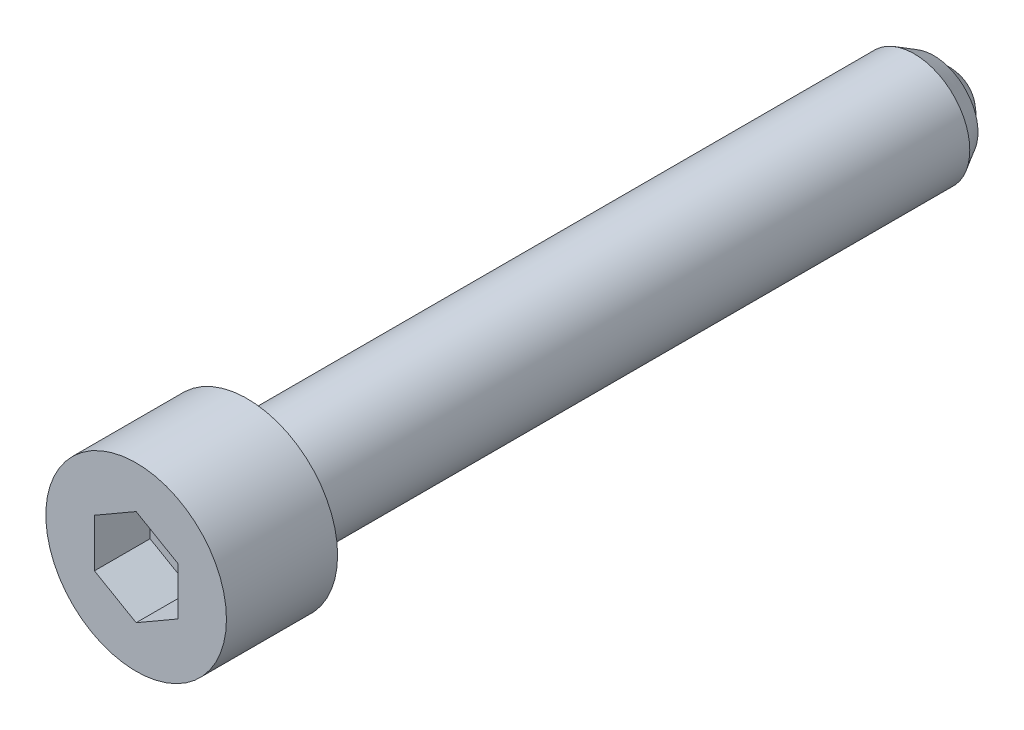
ISO-10303-21;
HEADER;
FILE_DESCRIPTION(('STEP AP214'),'2;1');
FILE_NAME('part.step','',(''),(''),'','','');
FILE_SCHEMA(('AUTOMOTIVE_DESIGN { 1 0 10303 214 1 1 1 1 }'));
ENDSEC;
DATA;
#1=APPLICATION_CONTEXT('core data for automotive mechanical design processes');
#2=APPLICATION_PROTOCOL_DEFINITION('international standard','automotive_design',2000,#1);
#3=PRODUCT_CONTEXT('',#1,'mechanical');
#4=PRODUCT('Part','Part','',(#3));
#5=PRODUCT_RELATED_PRODUCT_CATEGORY('part','',(#4));
#6=PRODUCT_DEFINITION_FORMATION('','',#4);
#7=PRODUCT_DEFINITION_CONTEXT('part definition',#1,'design');
#8=PRODUCT_DEFINITION('design','',#6,#7);
#9=PRODUCT_DEFINITION_SHAPE('','',#8);
#10=(LENGTH_UNIT() NAMED_UNIT(*) SI_UNIT(.MILLI.,.METRE.));
#11=(NAMED_UNIT(*) PLANE_ANGLE_UNIT() SI_UNIT($,.RADIAN.));
#12=(NAMED_UNIT(*) SI_UNIT($,.STERADIAN.) SOLID_ANGLE_UNIT());
#13=UNCERTAINTY_MEASURE_WITH_UNIT(LENGTH_MEASURE(1.E-05),#10,'distance_accuracy_value','');
#14=(GEOMETRIC_REPRESENTATION_CONTEXT(3) GLOBAL_UNCERTAINTY_ASSIGNED_CONTEXT((#13)) GLOBAL_UNIT_ASSIGNED_CONTEXT((#10,
#11,#12)) REPRESENTATION_CONTEXT('',''));
#15=CARTESIAN_POINT('',(0.,0.,0.));
#16=DIRECTION('',(0.,0.,1.));
#17=DIRECTION('',(1.,0.,0.));
#18=AXIS2_PLACEMENT_3D('',#15,#16,#17);
#19=CARTESIAN_POINT('',(0.,0.,2.75));
#20=DIRECTION('',(0.,0.,-1.));
#21=DIRECTION('',(1.,0.,0.));
#22=AXIS2_PLACEMENT_3D('',#19,#20,#21);
#23=SPHERICAL_SURFACE('',#22,2.75);
#24=CARTESIAN_POINT('',(0.,0.,1.90165736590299));
#25=DIRECTION('',(0.,0.,-1.));
#26=DIRECTION('',(1.,0.,0.));
#27=AXIS2_PLACEMENT_3D('',#24,#25,#26);
#28=CIRCLE('',#27,2.61587743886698);
#29=CARTESIAN_POINT('',(2.61587743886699,0.,1.90165736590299));
#30=VERTEX_POINT('',#29);
#31=EDGE_CURVE('E9',#30,#30,#28,.T.);
#32=ORIENTED_EDGE('',*,*,#31,.T.);
#33=EDGE_LOOP('',(#32));
#34=FACE_BOUND('',#33,.T.);
#35=ADVANCED_FACE('F14',(#34),#23,.T.);
#36=CARTESIAN_POINT('',(3.19170962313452,0.,1.90165736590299));
#37=DIRECTION('',(0.,0.,1.));
#38=DIRECTION('',(-1.,0.,0.));
#39=AXIS2_PLACEMENT_3D('',#36,#37,#38);
#40=PLANE('',#39);
#41=ORIENTED_EDGE('',*,*,#31,.F.);
#42=EDGE_LOOP('',(#41));
#43=FACE_BOUND('',#42,.T.);
#44=CARTESIAN_POINT('',(0.,0.,1.90165736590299));
#45=DIRECTION('',(0.,0.,-1.));
#46=DIRECTION('',(1.,0.,0.));
#47=AXIS2_PLACEMENT_3D('',#44,#45,#46);
#48=CIRCLE('',#47,3.19170962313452);
#49=CARTESIAN_POINT('',(3.19170962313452,0.,1.90165736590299));
#50=VERTEX_POINT('',#49);
#51=EDGE_CURVE('E21',#50,#50,#48,.T.);
#52=ORIENTED_EDGE('',*,*,#51,.T.);
#53=EDGE_LOOP('',(#52));
#54=FACE_BOUND('',#53,.T.);
#55=ADVANCED_FACE('F135',(#43,#54),#40,.F.);
#56=CARTESIAN_POINT('',(0.,0.,3.301657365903));
#57=DIRECTION('',(0.,0.,1.));
#58=DIRECTION('',(-1.,0.,0.));
#59=AXIS2_PLACEMENT_3D('',#56,#57,#58);
#60=CONICAL_SURFACE('',#59,4.,0.523598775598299);
#61=ORIENTED_EDGE('',*,*,#51,.F.);
#62=EDGE_LOOP('',(#61));
#63=FACE_BOUND('',#62,.T.);
#64=CARTESIAN_POINT('',(0.,0.,3.301657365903));
#65=DIRECTION('',(0.,0.,-1.));
#66=DIRECTION('',(1.,0.,0.));
#67=AXIS2_PLACEMENT_3D('',#64,#65,#66);
#68=CIRCLE('',#67,4.);
#69=CARTESIAN_POINT('',(4.,0.,3.301657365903));
#70=VERTEX_POINT('',#69);
#71=EDGE_CURVE('E130',#70,#70,#68,.T.);
#72=ORIENTED_EDGE('',*,*,#71,.T.);
#73=EDGE_LOOP('',(#72));
#74=FACE_BOUND('',#73,.T.);
#75=ADVANCED_FACE('F137',(#63,#74),#60,.T.);
#76=CARTESIAN_POINT('',(0.,0.,21.3));
#77=DIRECTION('',(0.,0.,-1.));
#78=DIRECTION('',(1.,0.,0.));
#79=AXIS2_PLACEMENT_3D('',#76,#77,#78);
#80=CYLINDRICAL_SURFACE('',#79,4.);
#81=ORIENTED_EDGE('',*,*,#71,.F.);
#82=EDGE_LOOP('',(#81));
#83=FACE_BOUND('',#82,.T.);
#84=CARTESIAN_POINT('',(0.,0.,51.3));
#85=DIRECTION('',(0.,0.,-1.));
#86=DIRECTION('',(1.,0.,0.));
#87=AXIS2_PLACEMENT_3D('',#84,#85,#86);
#88=CIRCLE('',#87,4.);
#89=CARTESIAN_POINT('',(4.,0.,51.3));
#90=VERTEX_POINT('',#89);
#91=EDGE_CURVE('E127',#90,#90,#88,.T.);
#92=ORIENTED_EDGE('',*,*,#91,.T.);
#93=EDGE_LOOP('',(#92));
#94=FACE_BOUND('',#93,.T.);
#95=ADVANCED_FACE('F140',(#83,#94),#80,.T.);
#96=CARTESIAN_POINT('',(4.,0.,51.3));
#97=DIRECTION('',(0.,0.,-1.));
#98=DIRECTION('',(1.,0.,0.));
#99=AXIS2_PLACEMENT_3D('',#96,#97,#98);
#100=PLANE('',#99);
#101=CARTESIAN_POINT('',(0.,0.,51.3));
#102=DIRECTION('',(0.,0.,-1.));
#103=DIRECTION('',(1.,0.,0.));
#104=AXIS2_PLACEMENT_3D('',#101,#102,#103);
#105=CIRCLE('',#104,6.5);
#106=CARTESIAN_POINT('',(6.5,0.,51.3));
#107=VERTEX_POINT('',#106);
#108=EDGE_CURVE('E124',#107,#107,#105,.T.);
#109=ORIENTED_EDGE('',*,*,#108,.T.);
#110=EDGE_LOOP('',(#109));
#111=FACE_BOUND('',#110,.T.);
#112=ORIENTED_EDGE('',*,*,#91,.F.);
#113=EDGE_LOOP('',(#112));
#114=FACE_BOUND('',#113,.T.);
#115=ADVANCED_FACE('F146',(#111,#114),#100,.T.);
#116=CARTESIAN_POINT('',(0.,0.,21.3));
#117=DIRECTION('',(0.,0.,-1.));
#118=DIRECTION('',(1.,0.,0.));
#119=AXIS2_PLACEMENT_3D('',#116,#117,#118);
#120=CYLINDRICAL_SURFACE('',#119,6.5);
#121=CARTESIAN_POINT('',(0.,0.,59.3));
#122=DIRECTION('',(0.,0.,-1.));
#123=DIRECTION('',(1.,0.,0.));
#124=AXIS2_PLACEMENT_3D('',#121,#122,#123);
#125=CIRCLE('',#124,6.5);
#126=CARTESIAN_POINT('',(6.5,0.,59.3));
#127=VERTEX_POINT('',#126);
#128=EDGE_CURVE('E121',#127,#127,#125,.T.);
#129=ORIENTED_EDGE('',*,*,#128,.T.);
#130=EDGE_LOOP('',(#129));
#131=FACE_BOUND('',#130,.T.);
#132=ORIENTED_EDGE('',*,*,#108,.F.);
#133=EDGE_LOOP('',(#132));
#134=FACE_BOUND('',#133,.T.);
#135=ADVANCED_FACE('F151',(#131,#134),#120,.T.);
#136=CARTESIAN_POINT('',(6.5,0.,59.3));
#137=DIRECTION('',(0.,0.,1.));
#138=DIRECTION('',(-1.,0.,0.));
#139=AXIS2_PLACEMENT_3D('',#136,#137,#138);
#140=PLANE('',#139);
#141=DIRECTION('',(-0.86602540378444,0.5,0.));
#142=VECTOR('',#141,1.);
#143=CARTESIAN_POINT('',(3.,1.73205080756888,59.3));
#144=LINE('',#143,#142);
#145=CARTESIAN_POINT('',(3.,1.73205080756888,59.3));
#146=VERTEX_POINT('',#145);
#147=CARTESIAN_POINT('',(0.,3.46410161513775,59.3));
#148=VERTEX_POINT('',#147);
#149=EDGE_CURVE('E28',#146,#148,#144,.T.);
#150=ORIENTED_EDGE('',*,*,#149,.F.);
#151=DIRECTION('',(0.,1.,0.));
#152=VECTOR('',#151,1.);
#153=CARTESIAN_POINT('',(3.,-1.73205080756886,59.3));
#154=LINE('',#153,#152);
#155=CARTESIAN_POINT('',(3.,-1.73205080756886,59.3));
#156=VERTEX_POINT('',#155);
#157=EDGE_CURVE('E97',#156,#146,#154,.T.);
#158=ORIENTED_EDGE('',*,*,#157,.F.);
#159=DIRECTION('',(-0.866025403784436,-0.5,0.));
#160=VECTOR('',#159,1.);
#161=CARTESIAN_POINT('',(3.,-1.73205080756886,59.3));
#162=LINE('',#161,#160);
#163=CARTESIAN_POINT('',(0.,-3.46410161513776,59.3));
#164=VERTEX_POINT('',#163);
#165=EDGE_CURVE('E92',#156,#164,#162,.T.);
#166=ORIENTED_EDGE('',*,*,#165,.T.);
#167=DIRECTION('',(0.866025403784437,-0.5,0.));
#168=VECTOR('',#167,1.);
#169=CARTESIAN_POINT('',(-3.,-1.73205080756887,59.3));
#170=LINE('',#169,#168);
#171=CARTESIAN_POINT('',(-3.,-1.73205080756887,59.3));
#172=VERTEX_POINT('',#171);
#173=EDGE_CURVE('E90',#172,#164,#170,.T.);
#174=ORIENTED_EDGE('',*,*,#173,.F.);
#175=DIRECTION('',(0.,1.,0.));
#176=VECTOR('',#175,1.);
#177=CARTESIAN_POINT('',(-3.,-1.73205080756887,59.3));
#178=LINE('',#177,#176);
#179=CARTESIAN_POINT('',(-3.,1.73205080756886,59.3));
#180=VERTEX_POINT('',#179);
#181=EDGE_CURVE('E71',#172,#180,#178,.T.);
#182=ORIENTED_EDGE('',*,*,#181,.T.);
#183=DIRECTION('',(0.866025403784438,0.5,0.));
#184=VECTOR('',#183,1.);
#185=CARTESIAN_POINT('',(-3.,1.73205080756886,59.3));
#186=LINE('',#185,#184);
#187=EDGE_CURVE('E82',#180,#148,#186,.T.);
#188=ORIENTED_EDGE('',*,*,#187,.T.);
#189=EDGE_LOOP('',(#150,#158,#166,#174,#182,#188));
#190=FACE_BOUND('',#189,.T.);
#191=ORIENTED_EDGE('',*,*,#128,.F.);
#192=EDGE_LOOP('',(#191));
#193=FACE_BOUND('',#192,.T.);
#194=ADVANCED_FACE('F86',(#190,#193),#140,.T.);
#195=CARTESIAN_POINT('',(3.,1.73205080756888,55.3));
#196=DIRECTION('',(0.5,0.86602540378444,0.));
#197=DIRECTION('',(0.86602540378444,-0.5,0.));
#198=AXIS2_PLACEMENT_3D('',#195,#196,#197);
#199=PLANE('',#198);
#200=DIRECTION('',(0.,0.,1.));
#201=VECTOR('',#200,1.);
#202=CARTESIAN_POINT('',(3.,1.73205080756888,55.3));
#203=LINE('',#202,#201);
#204=CARTESIAN_POINT('',(3.,1.73205080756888,55.3));
#205=VERTEX_POINT('',#204);
#206=EDGE_CURVE('E35',#205,#146,#203,.T.);
#207=ORIENTED_EDGE('',*,*,#206,.T.);
#208=ORIENTED_EDGE('',*,*,#149,.T.);
#209=DIRECTION('',(0.,0.,1.));
#210=VECTOR('',#209,1.);
#211=CARTESIAN_POINT('',(0.,3.46410161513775,55.3));
#212=LINE('',#211,#210);
#213=CARTESIAN_POINT('',(0.,3.46410161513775,55.3));
#214=VERTEX_POINT('',#213);
#215=EDGE_CURVE('E79',#214,#148,#212,.T.);
#216=ORIENTED_EDGE('',*,*,#215,.F.);
#217=DIRECTION('',(-0.86602540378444,0.5,0.));
#218=VECTOR('',#217,1.);
#219=CARTESIAN_POINT('',(3.,1.73205080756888,55.3));
#220=LINE('',#219,#218);
#221=EDGE_CURVE('E99',#205,#214,#220,.T.);
#222=ORIENTED_EDGE('',*,*,#221,.F.);
#223=EDGE_LOOP('',(#207,#208,#216,#222));
#224=FACE_BOUND('',#223,.T.);
#225=ADVANCED_FACE('F205',(#224),#199,.F.);
#226=CARTESIAN_POINT('',(3.,-1.73205080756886,55.3));
#227=DIRECTION('',(1.,0.,0.));
#228=DIRECTION('',(0.,-1.,0.));
#229=AXIS2_PLACEMENT_3D('',#226,#227,#228);
#230=PLANE('',#229);
#231=DIRECTION('',(0.,0.,1.));
#232=VECTOR('',#231,1.);
#233=CARTESIAN_POINT('',(3.,-1.73205080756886,55.3));
#234=LINE('',#233,#232);
#235=CARTESIAN_POINT('',(3.,-1.73205080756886,55.3));
#236=VERTEX_POINT('',#235);
#237=EDGE_CURVE('E118',#236,#156,#234,.T.);
#238=ORIENTED_EDGE('',*,*,#237,.T.);
#239=ORIENTED_EDGE('',*,*,#157,.T.);
#240=ORIENTED_EDGE('',*,*,#206,.F.);
#241=DIRECTION('',(0.,1.,0.));
#242=VECTOR('',#241,1.);
#243=CARTESIAN_POINT('',(3.,-1.73205080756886,55.3));
#244=LINE('',#243,#242);
#245=EDGE_CURVE('E111',#236,#205,#244,.T.);
#246=ORIENTED_EDGE('',*,*,#245,.F.);
#247=EDGE_LOOP('',(#238,#239,#240,#246));
#248=FACE_BOUND('',#247,.T.);
#249=ADVANCED_FACE('F214',(#248),#230,.F.);
#250=CARTESIAN_POINT('',(3.,-1.73205080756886,55.3));
#251=DIRECTION('',(-0.5,0.866025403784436,0.));
#252=DIRECTION('',(0.866025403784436,0.5,0.));
#253=AXIS2_PLACEMENT_3D('',#250,#251,#252);
#254=PLANE('',#253);
#255=DIRECTION('',(0.,0.,1.));
#256=VECTOR('',#255,1.);
#257=CARTESIAN_POINT('',(0.,-3.46410161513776,55.3));
#258=LINE('',#257,#256);
#259=CARTESIAN_POINT('',(0.,-3.46410161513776,55.3));
#260=VERTEX_POINT('',#259);
#261=EDGE_CURVE('E116',#260,#164,#258,.T.);
#262=ORIENTED_EDGE('',*,*,#261,.T.);
#263=ORIENTED_EDGE('',*,*,#165,.F.);
#264=ORIENTED_EDGE('',*,*,#237,.F.);
#265=DIRECTION('',(-0.866025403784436,-0.5,0.));
#266=VECTOR('',#265,1.);
#267=CARTESIAN_POINT('',(3.,-1.73205080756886,55.3));
#268=LINE('',#267,#266);
#269=EDGE_CURVE('E108',#236,#260,#268,.T.);
#270=ORIENTED_EDGE('',*,*,#269,.T.);
#271=EDGE_LOOP('',(#262,#263,#264,#270));
#272=FACE_BOUND('',#271,.T.);
#273=ADVANCED_FACE('F223',(#272),#254,.T.);
#274=CARTESIAN_POINT('',(-3.,-1.73205080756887,55.3));
#275=DIRECTION('',(-0.5,-0.866025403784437,0.));
#276=DIRECTION('',(-0.866025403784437,0.5,0.));
#277=AXIS2_PLACEMENT_3D('',#274,#275,#276);
#278=PLANE('',#277);
#279=DIRECTION('',(0.,0.,1.));
#280=VECTOR('',#279,1.);
#281=CARTESIAN_POINT('',(-3.,-1.73205080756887,55.3));
#282=LINE('',#281,#280);
#283=CARTESIAN_POINT('',(-3.,-1.73205080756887,55.3));
#284=VERTEX_POINT('',#283);
#285=EDGE_CURVE('E78',#284,#172,#282,.T.);
#286=ORIENTED_EDGE('',*,*,#285,.T.);
#287=ORIENTED_EDGE('',*,*,#173,.T.);
#288=ORIENTED_EDGE('',*,*,#261,.F.);
#289=DIRECTION('',(0.866025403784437,-0.5,0.));
#290=VECTOR('',#289,1.);
#291=CARTESIAN_POINT('',(-3.,-1.73205080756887,55.3));
#292=LINE('',#291,#290);
#293=EDGE_CURVE('E105',#284,#260,#292,.T.);
#294=ORIENTED_EDGE('',*,*,#293,.F.);
#295=EDGE_LOOP('',(#286,#287,#288,#294));
#296=FACE_BOUND('',#295,.T.);
#297=ADVANCED_FACE('F232',(#296),#278,.F.);
#298=CARTESIAN_POINT('',(-3.,-1.73205080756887,55.3));
#299=DIRECTION('',(1.,0.,0.));
#300=DIRECTION('',(0.,-1.,0.));
#301=AXIS2_PLACEMENT_3D('',#298,#299,#300);
#302=PLANE('',#301);
#303=DIRECTION('',(0.,0.,1.));
#304=VECTOR('',#303,1.);
#305=CARTESIAN_POINT('',(-3.,1.73205080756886,55.3));
#306=LINE('',#305,#304);
#307=CARTESIAN_POINT('',(-3.,1.73205080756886,55.3));
#308=VERTEX_POINT('',#307);
#309=EDGE_CURVE('E67',#308,#180,#306,.T.);
#310=ORIENTED_EDGE('',*,*,#309,.T.);
#311=ORIENTED_EDGE('',*,*,#181,.F.);
#312=ORIENTED_EDGE('',*,*,#285,.F.);
#313=DIRECTION('',(0.,1.,0.));
#314=VECTOR('',#313,1.);
#315=CARTESIAN_POINT('',(-3.,-1.73205080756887,55.3));
#316=LINE('',#315,#314);
#317=EDGE_CURVE('E74',#284,#308,#316,.T.);
#318=ORIENTED_EDGE('',*,*,#317,.T.);
#319=EDGE_LOOP('',(#310,#311,#312,#318));
#320=FACE_BOUND('',#319,.T.);
#321=ADVANCED_FACE('F69',(#320),#302,.T.);
#322=CARTESIAN_POINT('',(-3.,1.73205080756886,55.3));
#323=DIRECTION('',(0.5,-0.866025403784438,0.));
#324=DIRECTION('',(-0.866025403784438,-0.5,0.));
#325=AXIS2_PLACEMENT_3D('',#322,#323,#324);
#326=PLANE('',#325);
#327=DIRECTION('',(0.866025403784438,0.5,0.));
#328=VECTOR('',#327,1.);
#329=CARTESIAN_POINT('',(-3.,1.73205080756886,55.3));
#330=LINE('',#329,#328);
#331=EDGE_CURVE('E102',#308,#214,#330,.T.);
#332=ORIENTED_EDGE('',*,*,#331,.T.);
#333=ORIENTED_EDGE('',*,*,#215,.T.);
#334=ORIENTED_EDGE('',*,*,#187,.F.);
#335=ORIENTED_EDGE('',*,*,#309,.F.);
#336=EDGE_LOOP('',(#332,#333,#334,#335));
#337=FACE_BOUND('',#336,.T.);
#338=ADVANCED_FACE('F83',(#337),#326,.T.);
#339=CARTESIAN_POINT('',(6.,0.,55.3));
#340=DIRECTION('',(0.,0.,1.));
#341=DIRECTION('',(-1.,0.,0.));
#342=AXIS2_PLACEMENT_3D('',#339,#340,#341);
#343=PLANE('',#342);
#344=ORIENTED_EDGE('',*,*,#221,.T.);
#345=ORIENTED_EDGE('',*,*,#331,.F.);
#346=ORIENTED_EDGE('',*,*,#317,.F.);
#347=ORIENTED_EDGE('',*,*,#293,.T.);
#348=ORIENTED_EDGE('',*,*,#269,.F.);
#349=ORIENTED_EDGE('',*,*,#245,.T.);
#350=EDGE_LOOP('',(#344,#345,#346,#347,#348,#349));
#351=FACE_BOUND('',#350,.T.);
#352=ADVANCED_FACE('F252',(#351),#343,.T.);
#353=CLOSED_SHELL('',(#35,#55,#75,#95,#115,#135,#194,#225,#249,#273,#297,#321,#338,#352));
#354=MANIFOLD_SOLID_BREP('B1',#353);
#355=ADVANCED_BREP_SHAPE_REPRESENTATION('',(#18,#354),#14);
#356=SHAPE_DEFINITION_REPRESENTATION(#9,#355);
ENDSEC;
END-ISO-10303-21;
